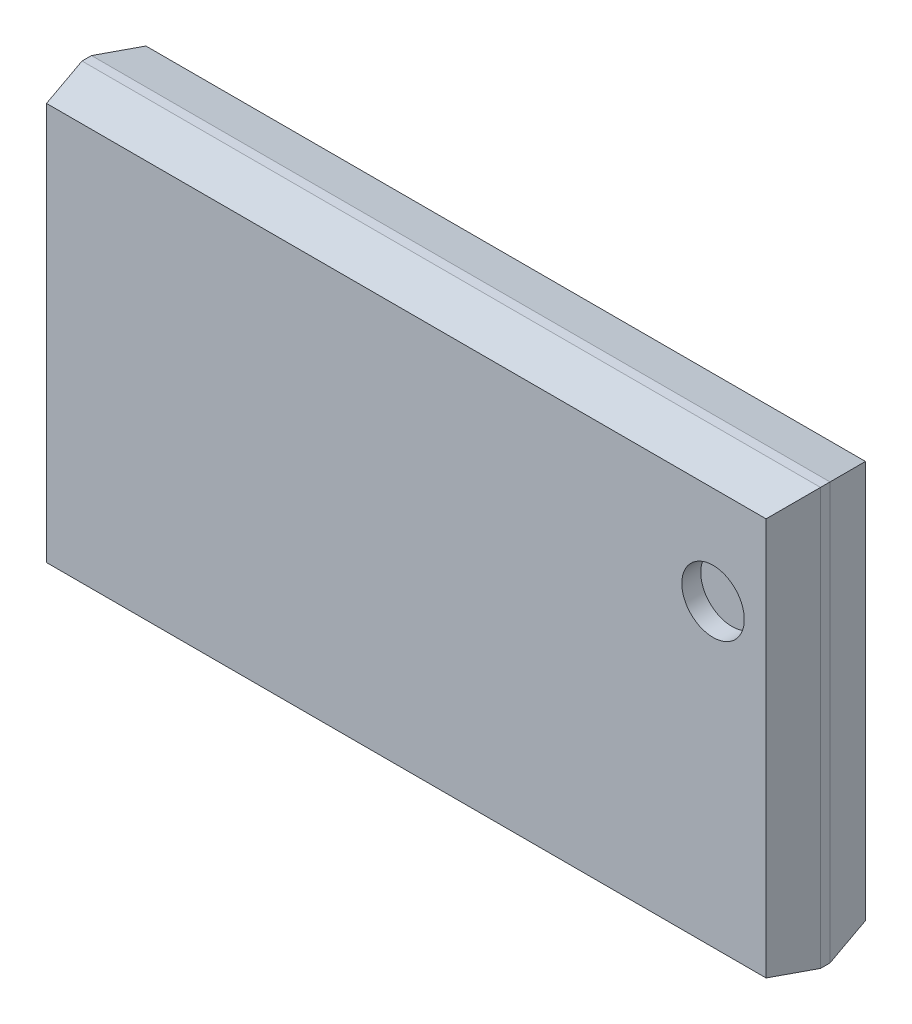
ISO-10303-21;
HEADER;
FILE_DESCRIPTION(('STEP AP214'),'2;1');
FILE_NAME('part.step','',(''),(''),'','','');
FILE_SCHEMA(('AUTOMOTIVE_DESIGN { 1 0 10303 214 1 1 1 1 }'));
ENDSEC;
DATA;
#1=APPLICATION_CONTEXT('core data for automotive mechanical design processes');
#2=APPLICATION_PROTOCOL_DEFINITION('international standard','automotive_design',2000,#1);
#3=PRODUCT_CONTEXT('',#1,'mechanical');
#4=PRODUCT('Part','Part','',(#3));
#5=PRODUCT_RELATED_PRODUCT_CATEGORY('part','',(#4));
#6=PRODUCT_DEFINITION_FORMATION('','',#4);
#7=PRODUCT_DEFINITION_CONTEXT('part definition',#1,'design');
#8=PRODUCT_DEFINITION('design','',#6,#7);
#9=PRODUCT_DEFINITION_SHAPE('','',#8);
#10=(LENGTH_UNIT() NAMED_UNIT(*) SI_UNIT(.MILLI.,.METRE.));
#11=(NAMED_UNIT(*) PLANE_ANGLE_UNIT() SI_UNIT($,.RADIAN.));
#12=(NAMED_UNIT(*) SI_UNIT($,.STERADIAN.) SOLID_ANGLE_UNIT());
#13=UNCERTAINTY_MEASURE_WITH_UNIT(LENGTH_MEASURE(1.E-05),#10,'distance_accuracy_value','');
#14=(GEOMETRIC_REPRESENTATION_CONTEXT(3) GLOBAL_UNCERTAINTY_ASSIGNED_CONTEXT((#13)) GLOBAL_UNIT_ASSIGNED_CONTEXT((#10,
#11,#12)) REPRESENTATION_CONTEXT('',''));
#15=CARTESIAN_POINT('',(0.,0.,0.));
#16=DIRECTION('',(0.,0.,1.));
#17=DIRECTION('',(1.,0.,0.));
#18=AXIS2_PLACEMENT_3D('',#15,#16,#17);
#19=CARTESIAN_POINT('',(3.24,1.065,1.));
#20=DIRECTION('',(0.,0.,1.));
#21=DIRECTION('',(1.,0.,0.));
#22=AXIS2_PLACEMENT_3D('',#19,#20,#21);
#23=PLANE('',#22);
#24=CARTESIAN_POINT('',(3.24,1.065,1.));
#25=DIRECTION('',(0.,0.,-1.));
#26=DIRECTION('',(-1.,0.,0.));
#27=AXIS2_PLACEMENT_3D('',#24,#25,#26);
#28=CIRCLE('',#27,0.33);
#29=CARTESIAN_POINT('',(2.91,1.065,1.));
#30=VERTEX_POINT('',#29);
#31=EDGE_CURVE('E19',#30,#30,#28,.F.);
#32=ORIENTED_EDGE('',*,*,#31,.T.);
#33=EDGE_LOOP('',(#32));
#34=FACE_BOUND('',#33,.T.);
#35=ADVANCED_FACE('F16',(#34),#23,.T.);
#36=CARTESIAN_POINT('',(3.24,1.065,1.2));
#37=DIRECTION('',(0.,0.,-1.));
#38=DIRECTION('',(-1.,0.,0.));
#39=AXIS2_PLACEMENT_3D('',#36,#37,#38);
#40=CYLINDRICAL_SURFACE('',#39,0.33);
#41=CARTESIAN_POINT('',(3.24,1.065,1.2));
#42=DIRECTION('',(0.,0.,-1.));
#43=DIRECTION('',(-1.,0.,0.));
#44=AXIS2_PLACEMENT_3D('',#41,#42,#43);
#45=CIRCLE('',#44,0.33);
#46=CARTESIAN_POINT('',(2.91,1.065,1.2));
#47=VERTEX_POINT('',#46);
#48=EDGE_CURVE('E93',#47,#47,#45,.T.);
#49=ORIENTED_EDGE('',*,*,#48,.F.);
#50=EDGE_LOOP('',(#49));
#51=FACE_BOUND('',#50,.T.);
#52=ORIENTED_EDGE('',*,*,#31,.F.);
#53=EDGE_LOOP('',(#52));
#54=FACE_BOUND('',#53,.T.);
#55=ADVANCED_FACE('F114',(#51,#54),#40,.F.);
#56=CARTESIAN_POINT('',(0.,0.,1.2));
#57=DIRECTION('',(0.,0.,1.));
#58=DIRECTION('',(1.,0.,0.));
#59=AXIS2_PLACEMENT_3D('',#56,#57,#58);
#60=PLANE('',#59);
#61=ORIENTED_EDGE('',*,*,#48,.T.);
#62=EDGE_LOOP('',(#61));
#63=FACE_BOUND('',#62,.T.);
#64=DIRECTION('',(0.,1.,0.));
#65=VECTOR('',#64,1.);
#66=CARTESIAN_POINT('',(-3.8,1.1,1.2));
#67=LINE('',#66,#65);
#68=CARTESIAN_POINT('',(-3.8,-2.1,1.2));
#69=VERTEX_POINT('',#68);
#70=CARTESIAN_POINT('',(-3.8,2.1,1.2));
#71=VERTEX_POINT('',#70);
#72=EDGE_CURVE('E96',#69,#71,#67,.T.);
#73=ORIENTED_EDGE('',*,*,#72,.F.);
#74=DIRECTION('',(1.,0.,0.));
#75=VECTOR('',#74,1.);
#76=CARTESIAN_POINT('',(-1.95,-2.1,1.2));
#77=LINE('',#76,#75);
#78=CARTESIAN_POINT('',(3.8,-2.1,1.2));
#79=VERTEX_POINT('',#78);
#80=EDGE_CURVE('E79',#79,#69,#77,.F.);
#81=ORIENTED_EDGE('',*,*,#80,.F.);
#82=DIRECTION('',(0.,1.,0.));
#83=VECTOR('',#82,1.);
#84=CARTESIAN_POINT('',(3.8,-1.1,1.2));
#85=LINE('',#84,#83);
#86=CARTESIAN_POINT('',(3.8,2.1,1.2));
#87=VERTEX_POINT('',#86);
#88=EDGE_CURVE('E84',#87,#79,#85,.F.);
#89=ORIENTED_EDGE('',*,*,#88,.F.);
#90=DIRECTION('',(1.,0.,0.));
#91=VECTOR('',#90,1.);
#92=CARTESIAN_POINT('',(1.95,2.1,1.2));
#93=LINE('',#92,#91);
#94=EDGE_CURVE('E279',#71,#87,#93,.T.);
#95=ORIENTED_EDGE('',*,*,#94,.F.);
#96=EDGE_LOOP('',(#73,#81,#89,#95));
#97=FACE_BOUND('',#96,.T.);
#98=ADVANCED_FACE('F95',(#63,#97),#60,.T.);
#99=CARTESIAN_POINT('',(3.85,-1.1,0.9625));
#100=DIRECTION('',(0.978549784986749,0.,0.206010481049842));
#101=DIRECTION('',(0.206010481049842,0.,-0.978549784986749));
#102=AXIS2_PLACEMENT_3D('',#99,#100,#101);
#103=PLANE('',#102);
#104=DIRECTION('',(-0.201773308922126,0.201773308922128,0.958423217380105));
#105=VECTOR('',#104,1.);
#106=CARTESIAN_POINT('',(3.9,-2.2,0.725));
#107=LINE('',#106,#105);
#108=CARTESIAN_POINT('',(3.9,-2.2,0.725));
#109=VERTEX_POINT('',#108);
#110=EDGE_CURVE('E86',#109,#79,#107,.T.);
#111=ORIENTED_EDGE('',*,*,#110,.F.);
#112=DIRECTION('',(0.,1.,0.));
#113=VECTOR('',#112,1.);
#114=CARTESIAN_POINT('',(3.9,-2.2,0.725));
#115=LINE('',#114,#113);
#116=CARTESIAN_POINT('',(3.9,2.2,0.725));
#117=VERTEX_POINT('',#116);
#118=EDGE_CURVE('E302',#117,#109,#115,.F.);
#119=ORIENTED_EDGE('',*,*,#118,.F.);
#120=DIRECTION('',(0.201773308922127,0.201773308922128,-0.958423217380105));
#121=VECTOR('',#120,1.);
#122=CARTESIAN_POINT('',(3.8,2.1,1.2));
#123=LINE('',#122,#121);
#124=EDGE_CURVE('E89',#87,#117,#123,.T.);
#125=ORIENTED_EDGE('',*,*,#124,.F.);
#126=ORIENTED_EDGE('',*,*,#88,.T.);
#127=EDGE_LOOP('',(#111,#119,#125,#126));
#128=FACE_BOUND('',#127,.T.);
#129=ADVANCED_FACE('F85',(#128),#103,.T.);
#130=CARTESIAN_POINT('',(-1.95,-2.15,0.9625));
#131=DIRECTION('',(0.,-0.978549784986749,0.206010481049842));
#132=DIRECTION('',(0.,-0.206010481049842,-0.978549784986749));
#133=AXIS2_PLACEMENT_3D('',#130,#131,#132);
#134=PLANE('',#133);
#135=DIRECTION('',(0.201773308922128,0.201773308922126,0.958423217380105));
#136=VECTOR('',#135,1.);
#137=CARTESIAN_POINT('',(-3.9,-2.2,0.725));
#138=LINE('',#137,#136);
#139=CARTESIAN_POINT('',(-3.9,-2.2,0.725));
#140=VERTEX_POINT('',#139);
#141=EDGE_CURVE('E98',#140,#69,#138,.T.);
#142=ORIENTED_EDGE('',*,*,#141,.F.);
#143=DIRECTION('',(1.,0.,0.));
#144=VECTOR('',#143,1.);
#145=CARTESIAN_POINT('',(-3.9,-2.2,0.725));
#146=LINE('',#145,#144);
#147=EDGE_CURVE('E103',#109,#140,#146,.F.);
#148=ORIENTED_EDGE('',*,*,#147,.F.);
#149=ORIENTED_EDGE('',*,*,#110,.T.);
#150=ORIENTED_EDGE('',*,*,#80,.T.);
#151=EDGE_LOOP('',(#142,#148,#149,#150));
#152=FACE_BOUND('',#151,.T.);
#153=ADVANCED_FACE('F101',(#152),#134,.T.);
#154=CARTESIAN_POINT('',(-3.85,1.1,0.9625));
#155=DIRECTION('',(-0.978549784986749,0.,0.206010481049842));
#156=DIRECTION('',(0.206010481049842,0.,0.978549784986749));
#157=AXIS2_PLACEMENT_3D('',#154,#155,#156);
#158=PLANE('',#157);
#159=DIRECTION('',(0.201773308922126,-0.201773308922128,0.958423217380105));
#160=VECTOR('',#159,1.);
#161=CARTESIAN_POINT('',(-3.9,2.2,0.725));
#162=LINE('',#161,#160);
#163=CARTESIAN_POINT('',(-3.9,2.2,0.725));
#164=VERTEX_POINT('',#163);
#165=EDGE_CURVE('E274',#164,#71,#162,.T.);
#166=ORIENTED_EDGE('',*,*,#165,.F.);
#167=DIRECTION('',(0.,1.,0.));
#168=VECTOR('',#167,1.);
#169=CARTESIAN_POINT('',(-3.9,2.2,0.725));
#170=LINE('',#169,#168);
#171=EDGE_CURVE('E276',#140,#164,#170,.T.);
#172=ORIENTED_EDGE('',*,*,#171,.F.);
#173=ORIENTED_EDGE('',*,*,#141,.T.);
#174=ORIENTED_EDGE('',*,*,#72,.T.);
#175=EDGE_LOOP('',(#166,#172,#173,#174));
#176=FACE_BOUND('',#175,.T.);
#177=ADVANCED_FACE('F165',(#176),#158,.T.);
#178=CARTESIAN_POINT('',(1.95,2.15,0.9625));
#179=DIRECTION('',(0.,0.978549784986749,0.206010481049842));
#180=DIRECTION('',(0.,-0.206010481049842,0.978549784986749));
#181=AXIS2_PLACEMENT_3D('',#178,#179,#180);
#182=PLANE('',#181);
#183=ORIENTED_EDGE('',*,*,#165,.T.);
#184=ORIENTED_EDGE('',*,*,#94,.T.);
#185=ORIENTED_EDGE('',*,*,#124,.T.);
#186=DIRECTION('',(-1.,0.,0.));
#187=VECTOR('',#186,1.);
#188=CARTESIAN_POINT('',(3.9,2.2,0.725));
#189=LINE('',#188,#187);
#190=EDGE_CURVE('E287',#164,#117,#189,.F.);
#191=ORIENTED_EDGE('',*,*,#190,.F.);
#192=EDGE_LOOP('',(#183,#184,#185,#191));
#193=FACE_BOUND('',#192,.T.);
#194=ADVANCED_FACE('F161',(#193),#182,.T.);
#195=CARTESIAN_POINT('',(3.9,-2.2,0.675));
#196=DIRECTION('',(1.,0.,0.));
#197=DIRECTION('',(0.,1.,0.));
#198=AXIS2_PLACEMENT_3D('',#195,#196,#197);
#199=PLANE('',#198);
#200=ORIENTED_EDGE('',*,*,#118,.T.);
#201=DIRECTION('',(0.,0.,1.));
#202=VECTOR('',#201,1.);
#203=CARTESIAN_POINT('',(3.9,-2.2,0.675));
#204=LINE('',#203,#202);
#205=CARTESIAN_POINT('',(3.9,-2.2,0.625));
#206=VERTEX_POINT('',#205);
#207=EDGE_CURVE('E300',#206,#109,#204,.T.);
#208=ORIENTED_EDGE('',*,*,#207,.F.);
#209=DIRECTION('',(0.,1.,0.));
#210=VECTOR('',#209,1.);
#211=CARTESIAN_POINT('',(3.9,-1.1,0.625));
#212=LINE('',#211,#210);
#213=CARTESIAN_POINT('',(3.9,2.2,0.625));
#214=VERTEX_POINT('',#213);
#215=EDGE_CURVE('E311',#214,#206,#212,.F.);
#216=ORIENTED_EDGE('',*,*,#215,.F.);
#217=DIRECTION('',(0.,0.,1.));
#218=VECTOR('',#217,1.);
#219=CARTESIAN_POINT('',(3.9,2.2,0.675));
#220=LINE('',#219,#218);
#221=EDGE_CURVE('E290',#117,#214,#220,.F.);
#222=ORIENTED_EDGE('',*,*,#221,.F.);
#223=EDGE_LOOP('',(#200,#208,#216,#222));
#224=FACE_BOUND('',#223,.T.);
#225=ADVANCED_FACE('F157',(#224),#199,.T.);
#226=CARTESIAN_POINT('',(-3.9,-2.2,0.675));
#227=DIRECTION('',(0.,-1.,0.));
#228=DIRECTION('',(1.,0.,0.));
#229=AXIS2_PLACEMENT_3D('',#226,#227,#228);
#230=PLANE('',#229);
#231=ORIENTED_EDGE('',*,*,#147,.T.);
#232=DIRECTION('',(0.,0.,1.));
#233=VECTOR('',#232,1.);
#234=CARTESIAN_POINT('',(-3.9,-2.2,0.675));
#235=LINE('',#234,#233);
#236=CARTESIAN_POINT('',(-3.9,-2.2,0.625));
#237=VERTEX_POINT('',#236);
#238=EDGE_CURVE('E284',#237,#140,#235,.T.);
#239=ORIENTED_EDGE('',*,*,#238,.F.);
#240=DIRECTION('',(1.,0.,0.));
#241=VECTOR('',#240,1.);
#242=CARTESIAN_POINT('',(-1.95,-2.2,0.625));
#243=LINE('',#242,#241);
#244=EDGE_CURVE('E308',#206,#237,#243,.F.);
#245=ORIENTED_EDGE('',*,*,#244,.F.);
#246=ORIENTED_EDGE('',*,*,#207,.T.);
#247=EDGE_LOOP('',(#231,#239,#245,#246));
#248=FACE_BOUND('',#247,.T.);
#249=ADVANCED_FACE('F153',(#248),#230,.T.);
#250=CARTESIAN_POINT('',(-3.9,2.2,0.675));
#251=DIRECTION('',(-1.,0.,0.));
#252=DIRECTION('',(0.,0.,1.));
#253=AXIS2_PLACEMENT_3D('',#250,#251,#252);
#254=PLANE('',#253);
#255=ORIENTED_EDGE('',*,*,#171,.T.);
#256=DIRECTION('',(0.,0.,1.));
#257=VECTOR('',#256,1.);
#258=CARTESIAN_POINT('',(-3.9,2.2,0.675));
#259=LINE('',#258,#257);
#260=CARTESIAN_POINT('',(-3.9,2.2,0.625));
#261=VERTEX_POINT('',#260);
#262=EDGE_CURVE('E283',#261,#164,#259,.T.);
#263=ORIENTED_EDGE('',*,*,#262,.F.);
#264=DIRECTION('',(0.,1.,0.));
#265=VECTOR('',#264,1.);
#266=CARTESIAN_POINT('',(-3.9,1.1,0.625));
#267=LINE('',#266,#265);
#268=EDGE_CURVE('E324',#237,#261,#267,.T.);
#269=ORIENTED_EDGE('',*,*,#268,.F.);
#270=ORIENTED_EDGE('',*,*,#238,.T.);
#271=EDGE_LOOP('',(#255,#263,#269,#270));
#272=FACE_BOUND('',#271,.T.);
#273=ADVANCED_FACE('F149',(#272),#254,.T.);
#274=CARTESIAN_POINT('',(3.9,2.2,0.675));
#275=DIRECTION('',(0.,1.,0.));
#276=DIRECTION('',(-1.,0.,0.));
#277=AXIS2_PLACEMENT_3D('',#274,#275,#276);
#278=PLANE('',#277);
#279=ORIENTED_EDGE('',*,*,#190,.T.);
#280=ORIENTED_EDGE('',*,*,#221,.T.);
#281=DIRECTION('',(1.,0.,0.));
#282=VECTOR('',#281,1.);
#283=CARTESIAN_POINT('',(1.95,2.2,0.625));
#284=LINE('',#283,#282);
#285=EDGE_CURVE('E294',#261,#214,#284,.T.);
#286=ORIENTED_EDGE('',*,*,#285,.F.);
#287=ORIENTED_EDGE('',*,*,#262,.T.);
#288=EDGE_LOOP('',(#279,#280,#286,#287));
#289=FACE_BOUND('',#288,.T.);
#290=ADVANCED_FACE('F145',(#289),#278,.T.);
#291=CARTESIAN_POINT('',(3.85,-1.1,0.3875));
#292=DIRECTION('',(0.978549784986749,0.,-0.206010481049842));
#293=DIRECTION('',(-0.206010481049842,0.,-0.978549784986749));
#294=AXIS2_PLACEMENT_3D('',#291,#292,#293);
#295=PLANE('',#294);
#296=DIRECTION('',(-0.201773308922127,-0.201773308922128,-0.958423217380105));
#297=VECTOR('',#296,1.);
#298=CARTESIAN_POINT('',(3.9,2.2,0.625));
#299=LINE('',#298,#297);
#300=CARTESIAN_POINT('',(3.8,2.1,0.15));
#301=VERTEX_POINT('',#300);
#302=EDGE_CURVE('E316',#214,#301,#299,.T.);
#303=ORIENTED_EDGE('',*,*,#302,.F.);
#304=ORIENTED_EDGE('',*,*,#215,.T.);
#305=DIRECTION('',(0.201773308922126,-0.201773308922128,0.958423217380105));
#306=VECTOR('',#305,1.);
#307=CARTESIAN_POINT('',(3.8,-2.1,0.15));
#308=LINE('',#307,#306);
#309=CARTESIAN_POINT('',(3.8,-2.1,0.15));
#310=VERTEX_POINT('',#309);
#311=EDGE_CURVE('E313',#310,#206,#308,.T.);
#312=ORIENTED_EDGE('',*,*,#311,.F.);
#313=DIRECTION('',(0.,1.,0.));
#314=VECTOR('',#313,1.);
#315=CARTESIAN_POINT('',(3.8,0.,0.15));
#316=LINE('',#315,#314);
#317=EDGE_CURVE('E329',#301,#310,#316,.F.);
#318=ORIENTED_EDGE('',*,*,#317,.F.);
#319=EDGE_LOOP('',(#303,#304,#312,#318));
#320=FACE_BOUND('',#319,.T.);
#321=ADVANCED_FACE('F141',(#320),#295,.T.);
#322=CARTESIAN_POINT('',(-1.95,-2.15,0.3875));
#323=DIRECTION('',(0.,-0.978549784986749,-0.206010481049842));
#324=DIRECTION('',(0.,0.206010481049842,-0.978549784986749));
#325=AXIS2_PLACEMENT_3D('',#322,#323,#324);
#326=PLANE('',#325);
#327=DIRECTION('',(-0.201773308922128,-0.201773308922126,0.958423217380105));
#328=VECTOR('',#327,1.);
#329=CARTESIAN_POINT('',(-3.8,-2.1,0.15));
#330=LINE('',#329,#328);
#331=CARTESIAN_POINT('',(-3.8,-2.1,0.15));
#332=VERTEX_POINT('',#331);
#333=EDGE_CURVE('E321',#332,#237,#330,.T.);
#334=ORIENTED_EDGE('',*,*,#333,.F.);
#335=DIRECTION('',(-1.,0.,0.));
#336=VECTOR('',#335,1.);
#337=CARTESIAN_POINT('',(0.,-2.1,0.15));
#338=LINE('',#337,#336);
#339=EDGE_CURVE('E332',#310,#332,#338,.T.);
#340=ORIENTED_EDGE('',*,*,#339,.F.);
#341=ORIENTED_EDGE('',*,*,#311,.T.);
#342=ORIENTED_EDGE('',*,*,#244,.T.);
#343=EDGE_LOOP('',(#334,#340,#341,#342));
#344=FACE_BOUND('',#343,.T.);
#345=ADVANCED_FACE('F138',(#344),#326,.T.);
#346=CARTESIAN_POINT('',(-3.85,1.1,0.3875));
#347=DIRECTION('',(-0.978549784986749,0.,-0.206010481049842));
#348=DIRECTION('',(-0.206010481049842,0.,0.978549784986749));
#349=AXIS2_PLACEMENT_3D('',#346,#347,#348);
#350=PLANE('',#349);
#351=ORIENTED_EDGE('',*,*,#333,.T.);
#352=ORIENTED_EDGE('',*,*,#268,.T.);
#353=DIRECTION('',(-0.201773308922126,0.201773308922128,0.958423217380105));
#354=VECTOR('',#353,1.);
#355=CARTESIAN_POINT('',(-3.8,2.1,0.15));
#356=LINE('',#355,#354);
#357=CARTESIAN_POINT('',(-3.8,2.1,0.15));
#358=VERTEX_POINT('',#357);
#359=EDGE_CURVE('E34',#358,#261,#356,.T.);
#360=ORIENTED_EDGE('',*,*,#359,.F.);
#361=DIRECTION('',(0.,1.,0.));
#362=VECTOR('',#361,1.);
#363=CARTESIAN_POINT('',(-3.8,0.,0.15));
#364=LINE('',#363,#362);
#365=EDGE_CURVE('E25',#332,#358,#364,.T.);
#366=ORIENTED_EDGE('',*,*,#365,.F.);
#367=EDGE_LOOP('',(#351,#352,#360,#366));
#368=FACE_BOUND('',#367,.T.);
#369=ADVANCED_FACE('F131',(#368),#350,.T.);
#370=CARTESIAN_POINT('',(1.95,2.15,0.3875));
#371=DIRECTION('',(0.,0.978549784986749,-0.206010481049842));
#372=DIRECTION('',(0.,0.206010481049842,0.978549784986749));
#373=AXIS2_PLACEMENT_3D('',#370,#371,#372);
#374=PLANE('',#373);
#375=ORIENTED_EDGE('',*,*,#359,.T.);
#376=ORIENTED_EDGE('',*,*,#285,.T.);
#377=ORIENTED_EDGE('',*,*,#302,.T.);
#378=DIRECTION('',(-1.,0.,0.));
#379=VECTOR('',#378,1.);
#380=CARTESIAN_POINT('',(0.,2.1,0.15));
#381=LINE('',#380,#379);
#382=EDGE_CURVE('E10',#358,#301,#381,.F.);
#383=ORIENTED_EDGE('',*,*,#382,.F.);
#384=EDGE_LOOP('',(#375,#376,#377,#383));
#385=FACE_BOUND('',#384,.T.);
#386=ADVANCED_FACE('F125',(#385),#374,.T.);
#387=CARTESIAN_POINT('',(0.,0.,0.15));
#388=DIRECTION('',(0.,0.,-1.));
#389=DIRECTION('',(-1.,0.,0.));
#390=AXIS2_PLACEMENT_3D('',#387,#388,#389);
#391=PLANE('',#390);
#392=ORIENTED_EDGE('',*,*,#365,.T.);
#393=ORIENTED_EDGE('',*,*,#382,.T.);
#394=ORIENTED_EDGE('',*,*,#317,.T.);
#395=ORIENTED_EDGE('',*,*,#339,.T.);
#396=EDGE_LOOP('',(#392,#393,#394,#395));
#397=FACE_BOUND('',#396,.T.);
#398=ADVANCED_FACE('F123',(#397),#391,.T.);
#399=CLOSED_SHELL('',(#35,#55,#98,#129,#153,#177,#194,#225,#249,#273,#290,#321,#345,#369,#386,#398));
#400=MANIFOLD_SOLID_BREP('B1',#399);
#401=ADVANCED_BREP_SHAPE_REPRESENTATION('',(#18,#400),#14);
#402=SHAPE_DEFINITION_REPRESENTATION(#9,#401);
ENDSEC;
END-ISO-10303-21;
